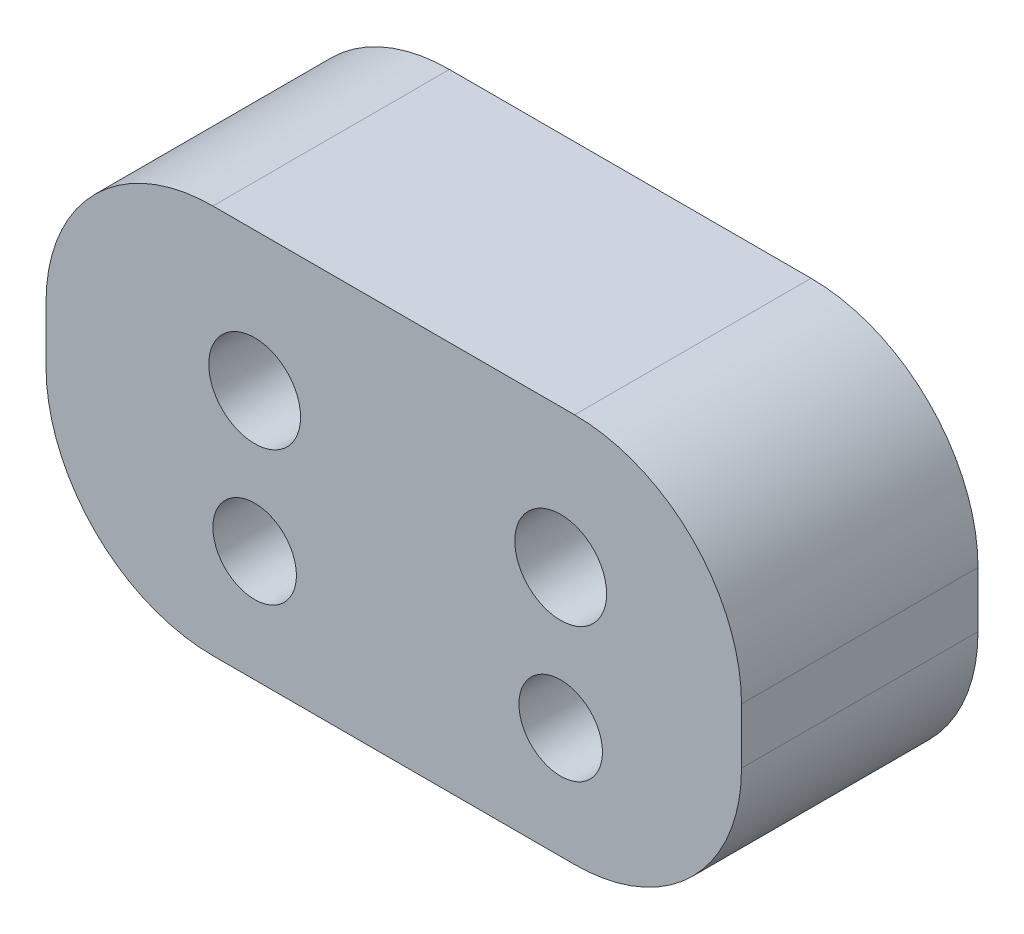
ISO-10303-21;
HEADER;
FILE_DESCRIPTION(('STEP AP214'),'2;1');
FILE_NAME('part.step','',(''),(''),'','','');
FILE_SCHEMA(('AUTOMOTIVE_DESIGN { 1 0 10303 214 1 1 1 1 }'));
ENDSEC;
DATA;
#1=APPLICATION_CONTEXT('core data for automotive mechanical design processes');
#2=APPLICATION_PROTOCOL_DEFINITION('international standard','automotive_design',2000,#1);
#3=PRODUCT_CONTEXT('',#1,'mechanical');
#4=PRODUCT('Part','Part','',(#3));
#5=PRODUCT_RELATED_PRODUCT_CATEGORY('part','',(#4));
#6=PRODUCT_DEFINITION_FORMATION('','',#4);
#7=PRODUCT_DEFINITION_CONTEXT('part definition',#1,'design');
#8=PRODUCT_DEFINITION('design','',#6,#7);
#9=PRODUCT_DEFINITION_SHAPE('','',#8);
#10=(LENGTH_UNIT() NAMED_UNIT(*) SI_UNIT(.MILLI.,.METRE.));
#11=(NAMED_UNIT(*) PLANE_ANGLE_UNIT() SI_UNIT($,.RADIAN.));
#12=(NAMED_UNIT(*) SI_UNIT($,.STERADIAN.) SOLID_ANGLE_UNIT());
#13=UNCERTAINTY_MEASURE_WITH_UNIT(LENGTH_MEASURE(1.E-05),#10,'distance_accuracy_value','');
#14=(GEOMETRIC_REPRESENTATION_CONTEXT(3) GLOBAL_UNCERTAINTY_ASSIGNED_CONTEXT((#13)) GLOBAL_UNIT_ASSIGNED_CONTEXT((#10,
#11,#12)) REPRESENTATION_CONTEXT('',''));
#15=CARTESIAN_POINT('',(0.,0.,0.));
#16=DIRECTION('',(0.,0.,1.));
#17=DIRECTION('',(1.,0.,0.));
#18=AXIS2_PLACEMENT_3D('',#15,#16,#17);
#19=CARTESIAN_POINT('',(6.00000000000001,-7.99999999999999,-8.5));
#20=DIRECTION('',(0.,0.,1.));
#21=DIRECTION('',(1.,0.,0.));
#22=AXIS2_PLACEMENT_3D('',#19,#20,#21);
#23=CYLINDRICAL_SURFACE('',#22,6.00000000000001);
#24=CARTESIAN_POINT('',(6.00000000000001,-7.99999999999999,0.));
#25=DIRECTION('',(0.,0.,1.));
#26=DIRECTION('',(1.,0.,0.));
#27=AXIS2_PLACEMENT_3D('',#24,#25,#26);
#28=CIRCLE('',#27,6.00000000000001);
#29=CARTESIAN_POINT('',(0.,-8.,0.));
#30=VERTEX_POINT('',#29);
#31=CARTESIAN_POINT('',(6.00000000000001,-14.,0.));
#32=VERTEX_POINT('',#31);
#33=EDGE_CURVE('E134',#30,#32,#28,.T.);
#34=ORIENTED_EDGE('',*,*,#33,.F.);
#35=DIRECTION('',(0.,0.,1.));
#36=VECTOR('',#35,1.);
#37=CARTESIAN_POINT('',(0.,-8.,-8.5));
#38=LINE('',#37,#36);
#39=CARTESIAN_POINT('',(0.,-8.,-8.5));
#40=VERTEX_POINT('',#39);
#41=EDGE_CURVE('E11',#40,#30,#38,.T.);
#42=ORIENTED_EDGE('',*,*,#41,.F.);
#43=CARTESIAN_POINT('',(6.00000000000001,-7.99999999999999,-8.5));
#44=DIRECTION('',(0.,0.,1.));
#45=DIRECTION('',(1.,0.,0.));
#46=AXIS2_PLACEMENT_3D('',#43,#44,#45);
#47=CIRCLE('',#46,6.00000000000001);
#48=CARTESIAN_POINT('',(6.00000000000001,-14.,-8.5));
#49=VERTEX_POINT('',#48);
#50=EDGE_CURVE('E155',#40,#49,#47,.T.);
#51=ORIENTED_EDGE('',*,*,#50,.T.);
#52=DIRECTION('',(0.,0.,1.));
#53=VECTOR('',#52,1.);
#54=CARTESIAN_POINT('',(6.00000000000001,-14.,-8.5));
#55=LINE('',#54,#53);
#56=EDGE_CURVE('E40',#49,#32,#55,.T.);
#57=ORIENTED_EDGE('',*,*,#56,.T.);
#58=EDGE_LOOP('',(#34,#42,#51,#57));
#59=FACE_BOUND('',#58,.T.);
#60=ADVANCED_FACE('F37',(#59),#23,.T.);
#61=CARTESIAN_POINT('',(0.,-6.00000000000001,-8.5));
#62=DIRECTION('',(-1.,0.,0.));
#63=DIRECTION('',(0.,-1.,0.));
#64=AXIS2_PLACEMENT_3D('',#61,#62,#63);
#65=PLANE('',#64);
#66=DIRECTION('',(0.,-1.,0.));
#67=VECTOR('',#66,1.);
#68=CARTESIAN_POINT('',(0.,-6.00000000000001,0.));
#69=LINE('',#68,#67);
#70=CARTESIAN_POINT('',(0.,-6.,0.));
#71=VERTEX_POINT('',#70);
#72=EDGE_CURVE('E153',#71,#30,#69,.T.);
#73=ORIENTED_EDGE('',*,*,#72,.F.);
#74=DIRECTION('',(0.,0.,1.));
#75=VECTOR('',#74,1.);
#76=CARTESIAN_POINT('',(0.,-6.,-8.5));
#77=LINE('',#76,#75);
#78=CARTESIAN_POINT('',(0.,-6.,-8.5));
#79=VERTEX_POINT('',#78);
#80=EDGE_CURVE('E46',#79,#71,#77,.T.);
#81=ORIENTED_EDGE('',*,*,#80,.F.);
#82=DIRECTION('',(0.,-1.,0.));
#83=VECTOR('',#82,1.);
#84=CARTESIAN_POINT('',(0.,-6.00000000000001,-8.5));
#85=LINE('',#84,#83);
#86=EDGE_CURVE('E124',#79,#40,#85,.T.);
#87=ORIENTED_EDGE('',*,*,#86,.T.);
#88=ORIENTED_EDGE('',*,*,#41,.T.);
#89=EDGE_LOOP('',(#73,#81,#87,#88));
#90=FACE_BOUND('',#89,.T.);
#91=ADVANCED_FACE('F167',(#90),#65,.T.);
#92=CARTESIAN_POINT('',(6.00000000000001,-6.00000000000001,-8.5));
#93=DIRECTION('',(0.,0.,1.));
#94=DIRECTION('',(1.,0.,0.));
#95=AXIS2_PLACEMENT_3D('',#92,#93,#94);
#96=CYLINDRICAL_SURFACE('',#95,6.00000000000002);
#97=CARTESIAN_POINT('',(6.00000000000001,-6.00000000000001,0.));
#98=DIRECTION('',(0.,0.,1.));
#99=DIRECTION('',(1.,0.,0.));
#100=AXIS2_PLACEMENT_3D('',#97,#98,#99);
#101=CIRCLE('',#100,6.00000000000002);
#102=CARTESIAN_POINT('',(6.00000000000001,0.,0.));
#103=VERTEX_POINT('',#102);
#104=EDGE_CURVE('E111',#103,#71,#101,.T.);
#105=ORIENTED_EDGE('',*,*,#104,.F.);
#106=DIRECTION('',(0.,0.,1.));
#107=VECTOR('',#106,1.);
#108=CARTESIAN_POINT('',(6.00000000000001,0.,-8.5));
#109=LINE('',#108,#107);
#110=CARTESIAN_POINT('',(6.00000000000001,0.,-8.5));
#111=VERTEX_POINT('',#110);
#112=EDGE_CURVE('E106',#111,#103,#109,.T.);
#113=ORIENTED_EDGE('',*,*,#112,.F.);
#114=CARTESIAN_POINT('',(6.00000000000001,-6.00000000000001,-8.5));
#115=DIRECTION('',(0.,0.,1.));
#116=DIRECTION('',(1.,0.,0.));
#117=AXIS2_PLACEMENT_3D('',#114,#115,#116);
#118=CIRCLE('',#117,6.00000000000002);
#119=EDGE_CURVE('E109',#111,#79,#118,.T.);
#120=ORIENTED_EDGE('',*,*,#119,.T.);
#121=ORIENTED_EDGE('',*,*,#80,.T.);
#122=EDGE_LOOP('',(#105,#113,#120,#121));
#123=FACE_BOUND('',#122,.T.);
#124=ADVANCED_FACE('F108',(#123),#96,.T.);
#125=CARTESIAN_POINT('',(19.,0.,-8.5));
#126=DIRECTION('',(0.,1.,0.));
#127=DIRECTION('',(-1.,0.,0.));
#128=AXIS2_PLACEMENT_3D('',#125,#126,#127);
#129=PLANE('',#128);
#130=DIRECTION('',(-1.,0.,0.));
#131=VECTOR('',#130,1.);
#132=CARTESIAN_POINT('',(19.,0.,0.));
#133=LINE('',#132,#131);
#134=CARTESIAN_POINT('',(19.,0.,0.));
#135=VERTEX_POINT('',#134);
#136=EDGE_CURVE('E150',#135,#103,#133,.T.);
#137=ORIENTED_EDGE('',*,*,#136,.F.);
#138=DIRECTION('',(0.,0.,1.));
#139=VECTOR('',#138,1.);
#140=CARTESIAN_POINT('',(19.,0.,-8.5));
#141=LINE('',#140,#139);
#142=CARTESIAN_POINT('',(19.,0.,-8.5));
#143=VERTEX_POINT('',#142);
#144=EDGE_CURVE('E116',#143,#135,#141,.T.);
#145=ORIENTED_EDGE('',*,*,#144,.F.);
#146=DIRECTION('',(-1.,0.,0.));
#147=VECTOR('',#146,1.);
#148=CARTESIAN_POINT('',(19.,0.,-8.5));
#149=LINE('',#148,#147);
#150=EDGE_CURVE('E122',#143,#111,#149,.T.);
#151=ORIENTED_EDGE('',*,*,#150,.T.);
#152=ORIENTED_EDGE('',*,*,#112,.T.);
#153=EDGE_LOOP('',(#137,#145,#151,#152));
#154=FACE_BOUND('',#153,.T.);
#155=ADVANCED_FACE('F126',(#154),#129,.T.);
#156=CARTESIAN_POINT('',(19.,-6.00000000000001,-8.5));
#157=DIRECTION('',(0.,0.,1.));
#158=DIRECTION('',(1.,0.,0.));
#159=AXIS2_PLACEMENT_3D('',#156,#157,#158);
#160=CYLINDRICAL_SURFACE('',#159,6.);
#161=CARTESIAN_POINT('',(19.,-6.00000000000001,0.));
#162=DIRECTION('',(0.,0.,1.));
#163=DIRECTION('',(1.,0.,0.));
#164=AXIS2_PLACEMENT_3D('',#161,#162,#163);
#165=CIRCLE('',#164,6.);
#166=CARTESIAN_POINT('',(25.,-6.00000000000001,0.));
#167=VERTEX_POINT('',#166);
#168=EDGE_CURVE('E147',#167,#135,#165,.T.);
#169=ORIENTED_EDGE('',*,*,#168,.F.);
#170=DIRECTION('',(0.,0.,1.));
#171=VECTOR('',#170,1.);
#172=CARTESIAN_POINT('',(25.,-6.00000000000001,-8.5));
#173=LINE('',#172,#171);
#174=CARTESIAN_POINT('',(25.,-6.00000000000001,-8.5));
#175=VERTEX_POINT('',#174);
#176=EDGE_CURVE('E159',#175,#167,#173,.T.);
#177=ORIENTED_EDGE('',*,*,#176,.F.);
#178=CARTESIAN_POINT('',(19.,-6.00000000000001,-8.5));
#179=DIRECTION('',(0.,0.,1.));
#180=DIRECTION('',(1.,0.,0.));
#181=AXIS2_PLACEMENT_3D('',#178,#179,#180);
#182=CIRCLE('',#181,6.);
#183=EDGE_CURVE('E127',#175,#143,#182,.T.);
#184=ORIENTED_EDGE('',*,*,#183,.T.);
#185=ORIENTED_EDGE('',*,*,#144,.T.);
#186=EDGE_LOOP('',(#169,#177,#184,#185));
#187=FACE_BOUND('',#186,.T.);
#188=ADVANCED_FACE('F180',(#187),#160,.T.);
#189=CARTESIAN_POINT('',(25.,-8.,-8.5));
#190=DIRECTION('',(1.,0.,0.));
#191=DIRECTION('',(0.,1.,0.));
#192=AXIS2_PLACEMENT_3D('',#189,#190,#191);
#193=PLANE('',#192);
#194=DIRECTION('',(0.,1.,0.));
#195=VECTOR('',#194,1.);
#196=CARTESIAN_POINT('',(25.,-8.,0.));
#197=LINE('',#196,#195);
#198=CARTESIAN_POINT('',(25.,-8.,0.));
#199=VERTEX_POINT('',#198);
#200=EDGE_CURVE('E144',#199,#167,#197,.T.);
#201=ORIENTED_EDGE('',*,*,#200,.F.);
#202=DIRECTION('',(0.,0.,1.));
#203=VECTOR('',#202,1.);
#204=CARTESIAN_POINT('',(25.,-8.,-8.5));
#205=LINE('',#204,#203);
#206=CARTESIAN_POINT('',(25.,-8.,-8.5));
#207=VERTEX_POINT('',#206);
#208=EDGE_CURVE('E161',#207,#199,#205,.T.);
#209=ORIENTED_EDGE('',*,*,#208,.F.);
#210=DIRECTION('',(0.,1.,0.));
#211=VECTOR('',#210,1.);
#212=CARTESIAN_POINT('',(25.,-8.,-8.5));
#213=LINE('',#212,#211);
#214=EDGE_CURVE('E129',#207,#175,#213,.T.);
#215=ORIENTED_EDGE('',*,*,#214,.T.);
#216=ORIENTED_EDGE('',*,*,#176,.T.);
#217=EDGE_LOOP('',(#201,#209,#215,#216));
#218=FACE_BOUND('',#217,.T.);
#219=ADVANCED_FACE('F183',(#218),#193,.T.);
#220=CARTESIAN_POINT('',(19.,-8.,-8.5));
#221=DIRECTION('',(0.,0.,1.));
#222=DIRECTION('',(1.,0.,0.));
#223=AXIS2_PLACEMENT_3D('',#220,#221,#222);
#224=CYLINDRICAL_SURFACE('',#223,6.);
#225=CARTESIAN_POINT('',(19.,-8.,0.));
#226=DIRECTION('',(0.,0.,1.));
#227=DIRECTION('',(1.,0.,0.));
#228=AXIS2_PLACEMENT_3D('',#225,#226,#227);
#229=CIRCLE('',#228,6.);
#230=CARTESIAN_POINT('',(19.,-14.,0.));
#231=VERTEX_POINT('',#230);
#232=EDGE_CURVE('E141',#231,#199,#229,.T.);
#233=ORIENTED_EDGE('',*,*,#232,.F.);
#234=DIRECTION('',(0.,0.,1.));
#235=VECTOR('',#234,1.);
#236=CARTESIAN_POINT('',(19.,-14.,-8.5));
#237=LINE('',#236,#235);
#238=CARTESIAN_POINT('',(19.,-14.,-8.5));
#239=VERTEX_POINT('',#238);
#240=EDGE_CURVE('E162',#239,#231,#237,.T.);
#241=ORIENTED_EDGE('',*,*,#240,.F.);
#242=CARTESIAN_POINT('',(19.,-8.,-8.5));
#243=DIRECTION('',(0.,0.,1.));
#244=DIRECTION('',(1.,0.,0.));
#245=AXIS2_PLACEMENT_3D('',#242,#243,#244);
#246=CIRCLE('',#245,6.);
#247=EDGE_CURVE('E249',#239,#207,#246,.T.);
#248=ORIENTED_EDGE('',*,*,#247,.T.);
#249=ORIENTED_EDGE('',*,*,#208,.T.);
#250=EDGE_LOOP('',(#233,#241,#248,#249));
#251=FACE_BOUND('',#250,.T.);
#252=ADVANCED_FACE('F187',(#251),#224,.T.);
#253=CARTESIAN_POINT('',(6.00000000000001,-14.,-8.5));
#254=DIRECTION('',(0.,-1.,0.));
#255=DIRECTION('',(0.,0.,-1.));
#256=AXIS2_PLACEMENT_3D('',#253,#254,#255);
#257=PLANE('',#256);
#258=DIRECTION('',(1.,0.,0.));
#259=VECTOR('',#258,1.);
#260=CARTESIAN_POINT('',(6.00000000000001,-14.,0.));
#261=LINE('',#260,#259);
#262=EDGE_CURVE('E137',#32,#231,#261,.T.);
#263=ORIENTED_EDGE('',*,*,#262,.F.);
#264=ORIENTED_EDGE('',*,*,#56,.F.);
#265=DIRECTION('',(1.,0.,0.));
#266=VECTOR('',#265,1.);
#267=CARTESIAN_POINT('',(6.00000000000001,-14.,-8.5));
#268=LINE('',#267,#266);
#269=EDGE_CURVE('E247',#49,#239,#268,.T.);
#270=ORIENTED_EDGE('',*,*,#269,.T.);
#271=ORIENTED_EDGE('',*,*,#240,.T.);
#272=EDGE_LOOP('',(#263,#264,#270,#271));
#273=FACE_BOUND('',#272,.T.);
#274=ADVANCED_FACE('F164',(#273),#257,.T.);
#275=CARTESIAN_POINT('',(6.00000000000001,-7.99999999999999,-8.5));
#276=DIRECTION('',(0.,0.,1.));
#277=DIRECTION('',(1.,0.,0.));
#278=AXIS2_PLACEMENT_3D('',#275,#276,#277);
#279=PLANE('',#278);
#280=CARTESIAN_POINT('',(7.49999999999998,-4.99999999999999,-8.5));
#281=DIRECTION('',(0.,0.,1.));
#282=DIRECTION('',(1.,0.,0.));
#283=AXIS2_PLACEMENT_3D('',#280,#281,#282);
#284=CIRCLE('',#283,1.65);
#285=CARTESIAN_POINT('',(9.14999999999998,-4.99999999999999,-8.5));
#286=VERTEX_POINT('',#285);
#287=EDGE_CURVE('E222',#286,#286,#284,.T.);
#288=ORIENTED_EDGE('',*,*,#287,.T.);
#289=EDGE_LOOP('',(#288));
#290=FACE_BOUND('',#289,.T.);
#291=CARTESIAN_POINT('',(18.5,-4.99999999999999,-8.5));
#292=DIRECTION('',(0.,0.,1.));
#293=DIRECTION('',(1.,0.,0.));
#294=AXIS2_PLACEMENT_3D('',#291,#292,#293);
#295=CIRCLE('',#294,1.65);
#296=CARTESIAN_POINT('',(20.15,-4.99999999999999,-8.5));
#297=VERTEX_POINT('',#296);
#298=EDGE_CURVE('E232',#297,#297,#295,.T.);
#299=ORIENTED_EDGE('',*,*,#298,.T.);
#300=EDGE_LOOP('',(#299));
#301=FACE_BOUND('',#300,.T.);
#302=CARTESIAN_POINT('',(18.5,-10.,-8.5));
#303=DIRECTION('',(0.,0.,1.));
#304=DIRECTION('',(-1.,0.,0.));
#305=AXIS2_PLACEMENT_3D('',#302,#303,#304);
#306=CIRCLE('',#305,1.5);
#307=CARTESIAN_POINT('',(17.,-10.,-8.5));
#308=VERTEX_POINT('',#307);
#309=EDGE_CURVE('E236',#308,#308,#306,.T.);
#310=ORIENTED_EDGE('',*,*,#309,.T.);
#311=EDGE_LOOP('',(#310));
#312=FACE_BOUND('',#311,.T.);
#313=CARTESIAN_POINT('',(7.49999999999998,-10.,-8.5));
#314=DIRECTION('',(0.,0.,1.));
#315=DIRECTION('',(-1.,0.,0.));
#316=AXIS2_PLACEMENT_3D('',#313,#314,#315);
#317=CIRCLE('',#316,1.5);
#318=CARTESIAN_POINT('',(5.99999999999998,-10.,-8.5));
#319=VERTEX_POINT('',#318);
#320=EDGE_CURVE('E138',#319,#319,#317,.T.);
#321=ORIENTED_EDGE('',*,*,#320,.T.);
#322=EDGE_LOOP('',(#321));
#323=FACE_BOUND('',#322,.T.);
#324=ORIENTED_EDGE('',*,*,#50,.F.);
#325=ORIENTED_EDGE('',*,*,#86,.F.);
#326=ORIENTED_EDGE('',*,*,#119,.F.);
#327=ORIENTED_EDGE('',*,*,#150,.F.);
#328=ORIENTED_EDGE('',*,*,#183,.F.);
#329=ORIENTED_EDGE('',*,*,#214,.F.);
#330=ORIENTED_EDGE('',*,*,#247,.F.);
#331=ORIENTED_EDGE('',*,*,#269,.F.);
#332=EDGE_LOOP('',(#324,#325,#326,#327,#328,#329,#330,#331));
#333=FACE_BOUND('',#332,.T.);
#334=ADVANCED_FACE('F120',(#290,#301,#312,#323,#333),#279,.F.);
#335=CARTESIAN_POINT('',(6.00000000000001,-7.99999999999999,0.));
#336=DIRECTION('',(0.,0.,1.));
#337=DIRECTION('',(1.,0.,0.));
#338=AXIS2_PLACEMENT_3D('',#335,#336,#337);
#339=PLANE('',#338);
#340=CARTESIAN_POINT('',(7.49999999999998,-4.99999999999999,0.));
#341=DIRECTION('',(0.,0.,1.));
#342=DIRECTION('',(1.,0.,0.));
#343=AXIS2_PLACEMENT_3D('',#340,#341,#342);
#344=CIRCLE('',#343,1.65);
#345=CARTESIAN_POINT('',(9.14999999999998,-4.99999999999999,0.));
#346=VERTEX_POINT('',#345);
#347=EDGE_CURVE('E225',#346,#346,#344,.T.);
#348=ORIENTED_EDGE('',*,*,#347,.F.);
#349=EDGE_LOOP('',(#348));
#350=FACE_BOUND('',#349,.T.);
#351=CARTESIAN_POINT('',(18.5,-4.99999999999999,0.));
#352=DIRECTION('',(0.,0.,1.));
#353=DIRECTION('',(1.,0.,0.));
#354=AXIS2_PLACEMENT_3D('',#351,#352,#353);
#355=CIRCLE('',#354,1.65);
#356=CARTESIAN_POINT('',(20.15,-4.99999999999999,0.));
#357=VERTEX_POINT('',#356);
#358=EDGE_CURVE('E227',#357,#357,#355,.T.);
#359=ORIENTED_EDGE('',*,*,#358,.F.);
#360=EDGE_LOOP('',(#359));
#361=FACE_BOUND('',#360,.T.);
#362=CARTESIAN_POINT('',(18.5,-10.,0.));
#363=DIRECTION('',(0.,0.,1.));
#364=DIRECTION('',(-1.,0.,0.));
#365=AXIS2_PLACEMENT_3D('',#362,#363,#364);
#366=CIRCLE('',#365,1.5);
#367=CARTESIAN_POINT('',(17.,-10.,0.));
#368=VERTEX_POINT('',#367);
#369=EDGE_CURVE('E235',#368,#368,#366,.T.);
#370=ORIENTED_EDGE('',*,*,#369,.F.);
#371=EDGE_LOOP('',(#370));
#372=FACE_BOUND('',#371,.T.);
#373=CARTESIAN_POINT('',(7.49999999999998,-10.,0.));
#374=DIRECTION('',(0.,0.,1.));
#375=DIRECTION('',(-1.,0.,0.));
#376=AXIS2_PLACEMENT_3D('',#373,#374,#375);
#377=CIRCLE('',#376,1.5);
#378=CARTESIAN_POINT('',(5.99999999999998,-10.,0.));
#379=VERTEX_POINT('',#378);
#380=EDGE_CURVE('E239',#379,#379,#377,.T.);
#381=ORIENTED_EDGE('',*,*,#380,.F.);
#382=EDGE_LOOP('',(#381));
#383=FACE_BOUND('',#382,.T.);
#384=ORIENTED_EDGE('',*,*,#33,.T.);
#385=ORIENTED_EDGE('',*,*,#262,.T.);
#386=ORIENTED_EDGE('',*,*,#232,.T.);
#387=ORIENTED_EDGE('',*,*,#200,.T.);
#388=ORIENTED_EDGE('',*,*,#168,.T.);
#389=ORIENTED_EDGE('',*,*,#136,.T.);
#390=ORIENTED_EDGE('',*,*,#104,.T.);
#391=ORIENTED_EDGE('',*,*,#72,.T.);
#392=EDGE_LOOP('',(#384,#385,#386,#387,#388,#389,#390,#391));
#393=FACE_BOUND('',#392,.T.);
#394=ADVANCED_FACE('F166',(#350,#361,#372,#383,#393),#339,.T.);
#395=CARTESIAN_POINT('',(7.49999999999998,-10.,-8.5));
#396=DIRECTION('',(0.,0.,1.));
#397=DIRECTION('',(1.,0.,0.));
#398=AXIS2_PLACEMENT_3D('',#395,#396,#397);
#399=CYLINDRICAL_SURFACE('',#398,1.5);
#400=ORIENTED_EDGE('',*,*,#320,.F.);
#401=EDGE_LOOP('',(#400));
#402=FACE_BOUND('',#401,.T.);
#403=ORIENTED_EDGE('',*,*,#380,.T.);
#404=EDGE_LOOP('',(#403));
#405=FACE_BOUND('',#404,.T.);
#406=ADVANCED_FACE('F199',(#402,#405),#399,.F.);
#407=CARTESIAN_POINT('',(18.5,-10.,-8.5));
#408=DIRECTION('',(0.,0.,1.));
#409=DIRECTION('',(1.,0.,0.));
#410=AXIS2_PLACEMENT_3D('',#407,#408,#409);
#411=CYLINDRICAL_SURFACE('',#410,1.5);
#412=ORIENTED_EDGE('',*,*,#309,.F.);
#413=EDGE_LOOP('',(#412));
#414=FACE_BOUND('',#413,.T.);
#415=ORIENTED_EDGE('',*,*,#369,.T.);
#416=EDGE_LOOP('',(#415));
#417=FACE_BOUND('',#416,.T.);
#418=ADVANCED_FACE('F206',(#414,#417),#411,.F.);
#419=CARTESIAN_POINT('',(18.5,-4.99999999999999,0.));
#420=DIRECTION('',(0.,0.,1.));
#421=DIRECTION('',(1.,0.,0.));
#422=AXIS2_PLACEMENT_3D('',#419,#420,#421);
#423=CYLINDRICAL_SURFACE('',#422,1.65);
#424=ORIENTED_EDGE('',*,*,#298,.F.);
#425=EDGE_LOOP('',(#424));
#426=FACE_BOUND('',#425,.T.);
#427=ORIENTED_EDGE('',*,*,#358,.T.);
#428=EDGE_LOOP('',(#427));
#429=FACE_BOUND('',#428,.T.);
#430=ADVANCED_FACE('F210',(#426,#429),#423,.F.);
#431=CARTESIAN_POINT('',(7.49999999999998,-4.99999999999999,0.));
#432=DIRECTION('',(0.,0.,1.));
#433=DIRECTION('',(1.,0.,0.));
#434=AXIS2_PLACEMENT_3D('',#431,#432,#433);
#435=CYLINDRICAL_SURFACE('',#434,1.65);
#436=ORIENTED_EDGE('',*,*,#287,.F.);
#437=EDGE_LOOP('',(#436));
#438=FACE_BOUND('',#437,.T.);
#439=ORIENTED_EDGE('',*,*,#347,.T.);
#440=EDGE_LOOP('',(#439));
#441=FACE_BOUND('',#440,.T.);
#442=ADVANCED_FACE('F214',(#438,#441),#435,.F.);
#443=CLOSED_SHELL('',(#60,#91,#124,#155,#188,#219,#252,#274,#334,#394,#406,#418,#430,#442));
#444=MANIFOLD_SOLID_BREP('B2',#443);
#445=ADVANCED_BREP_SHAPE_REPRESENTATION('',(#18,#444),#14);
#446=SHAPE_DEFINITION_REPRESENTATION(#9,#445);
ENDSEC;
END-ISO-10303-21;
